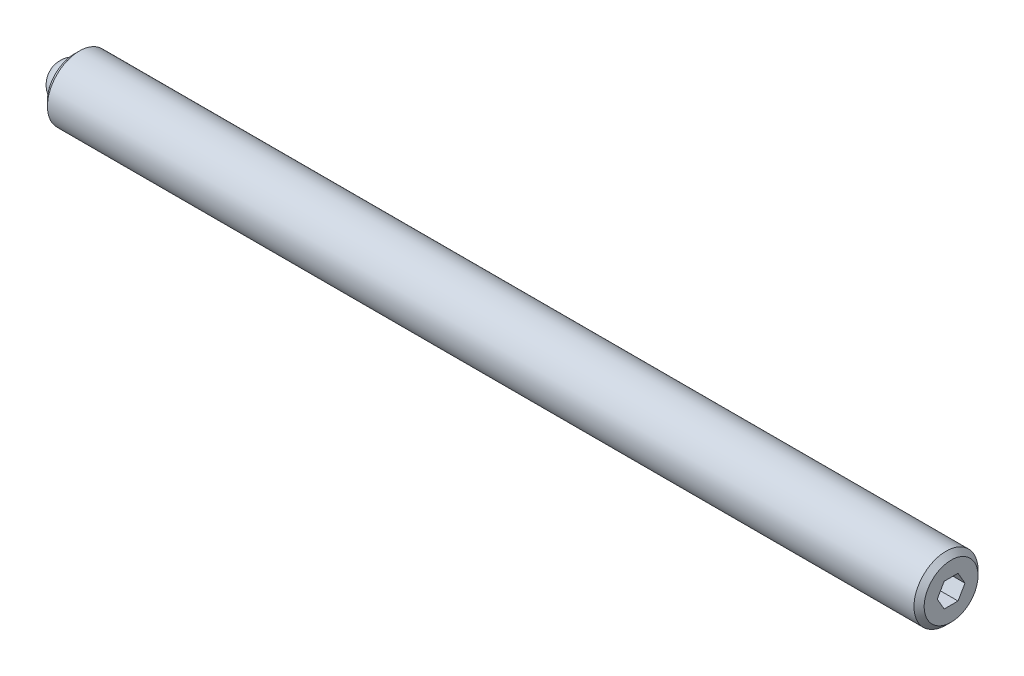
from build123d import *

# Parameters (mm, degrees)
SKETCH2_R           = 3.175
BOSS_EXTRUDE1_DEPTH = 86.915625
CHAMFER1_SIZE       = 0.508
CHAMFER2_SIZE       = 0.508
CUT_EXTRUDE2_DEPTH  = 2.286
SKETCH3_R           = 1.9812
CUT_EXTRUDE3_DEPTH  = 1.984375


with BuildPart() as part:
    # Sketch2 → Boss-Extrude1 (new body)
    with BuildSketch(Plane(origin=(0, 0, 0), x_dir=(0, 0, -1), z_dir=(1, 0, 0))):
        Circle(SKETCH2_R)
    extrude(amount=BOSS_EXTRUDE1_DEPTH)

    # Chamfer1
    chamfer1_edges = [part.edges().sort_by_distance(p)[0] for p in [
        (0, 0, 3.175),
    ]]
    chamfer(chamfer1_edges, length=CHAMFER1_SIZE)

    # Chamfer2
    chamfer2_edges = [part.edges().sort_by_distance(p)[0] for p in [
        (86.915625, 0, 3.175),
    ]]
    chamfer(chamfer2_edges, length=CHAMFER2_SIZE)

    # Sketch4 → Cut-Extrude2 (cut)
    with BuildSketch(Plane(origin=(86.915625, 0, 0), x_dir=(0, 0, -1), z_dir=(1, 0, 0))):
        Polygon((1.374815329, 0), (0.687407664, 1.190625), (-0.687407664, 1.190625), (-1.374815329, 0), (-0.687407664, -1.190625), (0.687407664, -1.190625), align=None)
    extrude(amount=-CUT_EXTRUDE2_DEPTH, mode=Mode.SUBTRACT)

    # Sketch3 → Cut-Extrude3 (cut)
    with BuildSketch(Plane.ZY):
        Circle(SKETCH3_R)
    extrude(amount=-CUT_EXTRUDE3_DEPTH, mode=Mode.SUBTRACT)


with BuildPart() as body_2:
    # Sketch5 → Revolve1 (revolve)
    with BuildSketch(Plane.ZY):
        with BuildLine():
            Line((0, 0), (0, -1.984375))
            ThreePointArc((0, -1.984375), (-1.984375, 0), (0, 1.984375))
            Line((0, 1.984375), (0, 0))
        make_face()
    revolve(axis=Axis((0, 0, 0), (0, 1, 0)))


solid = Compound([part.part, body_2.part])
